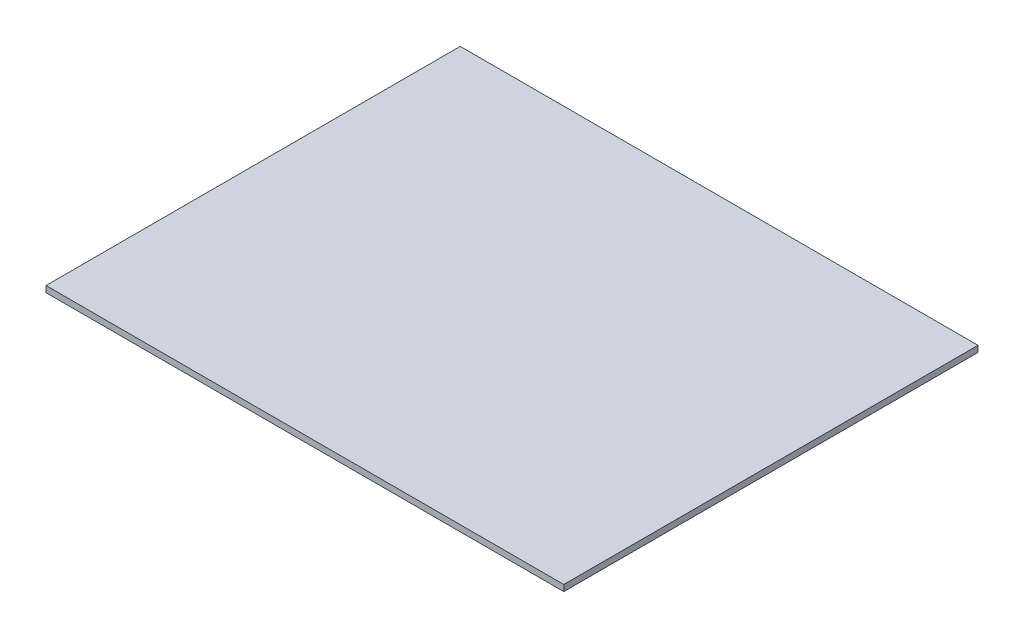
ISO-10303-21;
HEADER;
FILE_DESCRIPTION(('STEP AP214'),'2;1');
FILE_NAME('part.step','',(''),(''),'','','');
FILE_SCHEMA(('AUTOMOTIVE_DESIGN { 1 0 10303 214 1 1 1 1 }'));
ENDSEC;
DATA;
#1=APPLICATION_CONTEXT('core data for automotive mechanical design processes');
#2=APPLICATION_PROTOCOL_DEFINITION('international standard','automotive_design',2000,#1);
#3=PRODUCT_CONTEXT('',#1,'mechanical');
#4=PRODUCT('Part','Part','',(#3));
#5=PRODUCT_RELATED_PRODUCT_CATEGORY('part','',(#4));
#6=PRODUCT_DEFINITION_FORMATION('','',#4);
#7=PRODUCT_DEFINITION_CONTEXT('part definition',#1,'design');
#8=PRODUCT_DEFINITION('design','',#6,#7);
#9=PRODUCT_DEFINITION_SHAPE('','',#8);
#10=(LENGTH_UNIT() NAMED_UNIT(*) SI_UNIT(.MILLI.,.METRE.));
#11=(NAMED_UNIT(*) PLANE_ANGLE_UNIT() SI_UNIT($,.RADIAN.));
#12=(NAMED_UNIT(*) SI_UNIT($,.STERADIAN.) SOLID_ANGLE_UNIT());
#13=UNCERTAINTY_MEASURE_WITH_UNIT(LENGTH_MEASURE(1.E-05),#10,'distance_accuracy_value','');
#14=(GEOMETRIC_REPRESENTATION_CONTEXT(3) GLOBAL_UNCERTAINTY_ASSIGNED_CONTEXT((#13)) GLOBAL_UNIT_ASSIGNED_CONTEXT((#10,
#11,#12)) REPRESENTATION_CONTEXT('',''));
#15=CARTESIAN_POINT('',(0.,0.,0.));
#16=DIRECTION('',(0.,0.,1.));
#17=DIRECTION('',(1.,0.,0.));
#18=AXIS2_PLACEMENT_3D('',#15,#16,#17);
#19=CARTESIAN_POINT('',(-1219.2,18.25625,-609.6));
#20=DIRECTION('',(0.,0.,1.));
#21=DIRECTION('',(1.,0.,0.));
#22=AXIS2_PLACEMENT_3D('',#19,#20,#21);
#23=PLANE('',#22);
#24=DIRECTION('',(-1.,0.,0.));
#25=VECTOR('',#24,1.);
#26=CARTESIAN_POINT('',(-1219.2,18.25625,-609.6));
#27=LINE('',#26,#25);
#28=CARTESIAN_POINT('',(304.8,18.25625,-609.6));
#29=VERTEX_POINT('',#28);
#30=CARTESIAN_POINT('',(-1219.2,18.25625,-609.6));
#31=VERTEX_POINT('',#30);
#32=EDGE_CURVE('E84',#29,#31,#27,.T.);
#33=ORIENTED_EDGE('',*,*,#32,.F.);
#34=DIRECTION('',(0.,1.,0.));
#35=VECTOR('',#34,1.);
#36=CARTESIAN_POINT('',(304.8,0.,-609.6));
#37=LINE('',#36,#35);
#38=CARTESIAN_POINT('',(304.8,0.,-609.6));
#39=VERTEX_POINT('',#38);
#40=EDGE_CURVE('E91',#39,#29,#37,.T.);
#41=ORIENTED_EDGE('',*,*,#40,.F.);
#42=DIRECTION('',(-1.,0.,0.));
#43=VECTOR('',#42,1.);
#44=CARTESIAN_POINT('',(-1219.2,0.,-609.6));
#45=LINE('',#44,#43);
#46=CARTESIAN_POINT('',(-1219.2,0.,-609.6));
#47=VERTEX_POINT('',#46);
#48=EDGE_CURVE('E76',#39,#47,#45,.T.);
#49=ORIENTED_EDGE('',*,*,#48,.T.);
#50=DIRECTION('',(0.,-1.,0.));
#51=VECTOR('',#50,1.);
#52=CARTESIAN_POINT('',(-1219.2,18.25625,-609.6));
#53=LINE('',#52,#51);
#54=EDGE_CURVE('E11',#31,#47,#53,.T.);
#55=ORIENTED_EDGE('',*,*,#54,.F.);
#56=EDGE_LOOP('',(#33,#41,#49,#55));
#57=FACE_BOUND('',#56,.T.);
#58=ADVANCED_FACE('F32',(#57),#23,.F.);
#59=CARTESIAN_POINT('',(-1219.2,18.25625,-609.6));
#60=DIRECTION('',(1.,0.,0.));
#61=DIRECTION('',(0.,0.,-1.));
#62=AXIS2_PLACEMENT_3D('',#59,#60,#61);
#63=PLANE('',#62);
#64=DIRECTION('',(0.,0.,1.));
#65=VECTOR('',#64,1.);
#66=CARTESIAN_POINT('',(-1219.2,0.,-609.6));
#67=LINE('',#66,#65);
#68=CARTESIAN_POINT('',(-1219.2,0.,609.6));
#69=VERTEX_POINT('',#68);
#70=EDGE_CURVE('E67',#47,#69,#67,.T.);
#71=ORIENTED_EDGE('',*,*,#70,.T.);
#72=DIRECTION('',(0.,-1.,0.));
#73=VECTOR('',#72,1.);
#74=CARTESIAN_POINT('',(-1219.2,18.25625,609.6));
#75=LINE('',#74,#73);
#76=CARTESIAN_POINT('',(-1219.2,18.25625,609.6));
#77=VERTEX_POINT('',#76);
#78=EDGE_CURVE('E39',#77,#69,#75,.T.);
#79=ORIENTED_EDGE('',*,*,#78,.F.);
#80=DIRECTION('',(0.,0.,1.));
#81=VECTOR('',#80,1.);
#82=CARTESIAN_POINT('',(-1219.2,18.25625,-609.6));
#83=LINE('',#82,#81);
#84=EDGE_CURVE('E55',#31,#77,#83,.T.);
#85=ORIENTED_EDGE('',*,*,#84,.F.);
#86=ORIENTED_EDGE('',*,*,#54,.T.);
#87=EDGE_LOOP('',(#71,#79,#85,#86));
#88=FACE_BOUND('',#87,.T.);
#89=ADVANCED_FACE('F69',(#88),#63,.F.);
#90=CARTESIAN_POINT('',(-1219.2,18.25625,609.6));
#91=DIRECTION('',(0.,0.,-1.));
#92=DIRECTION('',(-1.,0.,0.));
#93=AXIS2_PLACEMENT_3D('',#90,#91,#92);
#94=PLANE('',#93);
#95=DIRECTION('',(1.,0.,0.));
#96=VECTOR('',#95,1.);
#97=CARTESIAN_POINT('',(-1219.2,0.,609.6));
#98=LINE('',#97,#96);
#99=CARTESIAN_POINT('',(304.8,0.,609.6));
#100=VERTEX_POINT('',#99);
#101=EDGE_CURVE('E75',#69,#100,#98,.T.);
#102=ORIENTED_EDGE('',*,*,#101,.T.);
#103=DIRECTION('',(0.,1.,0.));
#104=VECTOR('',#103,1.);
#105=CARTESIAN_POINT('',(304.800000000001,0.,609.6));
#106=LINE('',#105,#104);
#107=CARTESIAN_POINT('',(304.800000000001,18.25625,609.6));
#108=VERTEX_POINT('',#107);
#109=EDGE_CURVE('E46',#100,#108,#106,.T.);
#110=ORIENTED_EDGE('',*,*,#109,.T.);
#111=DIRECTION('',(1.,0.,0.));
#112=VECTOR('',#111,1.);
#113=CARTESIAN_POINT('',(-1219.2,18.25625,609.6));
#114=LINE('',#113,#112);
#115=EDGE_CURVE('E81',#77,#108,#114,.T.);
#116=ORIENTED_EDGE('',*,*,#115,.F.);
#117=ORIENTED_EDGE('',*,*,#78,.T.);
#118=EDGE_LOOP('',(#102,#110,#116,#117));
#119=FACE_BOUND('',#118,.T.);
#120=ADVANCED_FACE('F80',(#119),#94,.F.);
#121=CARTESIAN_POINT('',(0.,18.25625,0.));
#122=DIRECTION('',(0.,1.,0.));
#123=DIRECTION('',(0.,0.,1.));
#124=AXIS2_PLACEMENT_3D('',#121,#122,#123);
#125=PLANE('',#124);
#126=DIRECTION('',(0.,0.,1.));
#127=VECTOR('',#126,1.);
#128=CARTESIAN_POINT('',(304.8,18.25625,-609.6));
#129=LINE('',#128,#127);
#130=EDGE_CURVE('E95',#29,#108,#129,.T.);
#131=ORIENTED_EDGE('',*,*,#130,.F.);
#132=ORIENTED_EDGE('',*,*,#32,.T.);
#133=ORIENTED_EDGE('',*,*,#84,.T.);
#134=ORIENTED_EDGE('',*,*,#115,.T.);
#135=EDGE_LOOP('',(#131,#132,#133,#134));
#136=FACE_BOUND('',#135,.T.);
#137=ADVANCED_FACE('F103',(#136),#125,.T.);
#138=CARTESIAN_POINT('',(0.,0.,0.));
#139=DIRECTION('',(0.,1.,0.));
#140=DIRECTION('',(0.,0.,1.));
#141=AXIS2_PLACEMENT_3D('',#138,#139,#140);
#142=PLANE('',#141);
#143=ORIENTED_EDGE('',*,*,#48,.F.);
#144=DIRECTION('',(0.,0.,1.));
#145=VECTOR('',#144,1.);
#146=CARTESIAN_POINT('',(304.8,0.,-609.6));
#147=LINE('',#146,#145);
#148=EDGE_CURVE('E83',#39,#100,#147,.T.);
#149=ORIENTED_EDGE('',*,*,#148,.T.);
#150=ORIENTED_EDGE('',*,*,#101,.F.);
#151=ORIENTED_EDGE('',*,*,#70,.F.);
#152=EDGE_LOOP('',(#143,#149,#150,#151));
#153=FACE_BOUND('',#152,.T.);
#154=ADVANCED_FACE('F82',(#153),#142,.F.);
#155=CARTESIAN_POINT('',(304.8,0.,-609.6));
#156=DIRECTION('',(-1.,0.,0.));
#157=DIRECTION('',(0.,0.,1.));
#158=AXIS2_PLACEMENT_3D('',#155,#156,#157);
#159=PLANE('',#158);
#160=ORIENTED_EDGE('',*,*,#130,.T.);
#161=ORIENTED_EDGE('',*,*,#109,.F.);
#162=ORIENTED_EDGE('',*,*,#148,.F.);
#163=ORIENTED_EDGE('',*,*,#40,.T.);
#164=EDGE_LOOP('',(#160,#161,#162,#163));
#165=FACE_BOUND('',#164,.T.);
#166=ADVANCED_FACE('F99',(#165),#159,.F.);
#167=CLOSED_SHELL('',(#58,#89,#120,#137,#154,#166));
#168=MANIFOLD_SOLID_BREP('B2',#167);
#169=ADVANCED_BREP_SHAPE_REPRESENTATION('',(#18,#168),#14);
#170=SHAPE_DEFINITION_REPRESENTATION(#9,#169);
ENDSEC;
END-ISO-10303-21;
